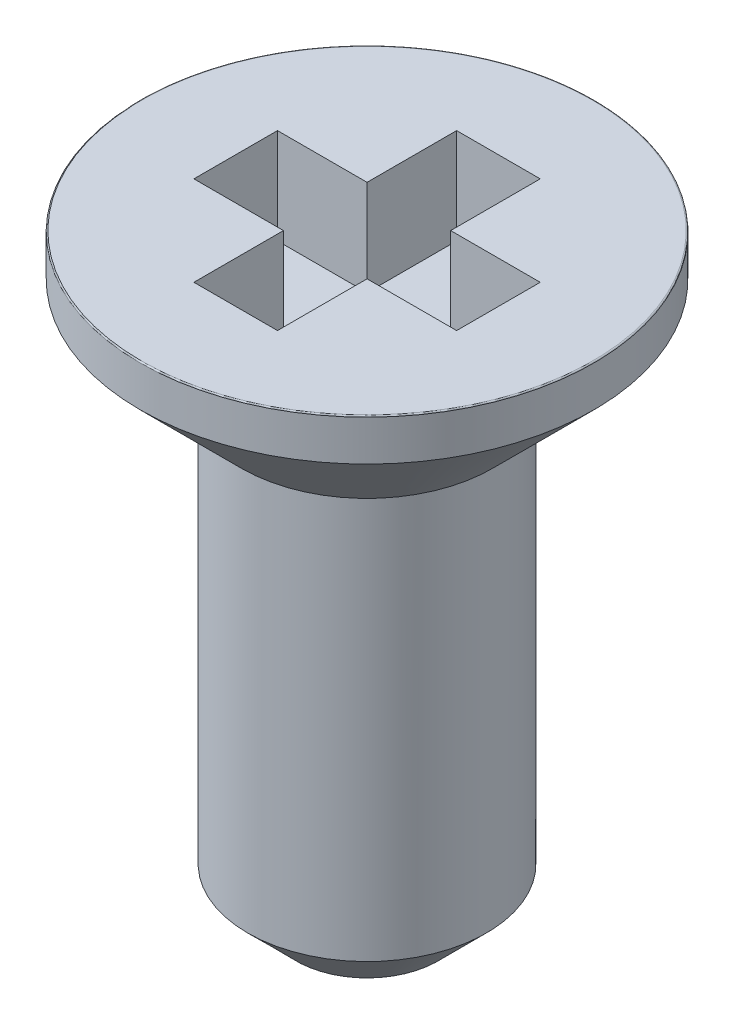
ISO-10303-21;
HEADER;
FILE_DESCRIPTION(('STEP AP214'),'2;1');
FILE_NAME('part.step','',(''),(''),'','','');
FILE_SCHEMA(('AUTOMOTIVE_DESIGN { 1 0 10303 214 1 1 1 1 }'));
ENDSEC;
DATA;
#1=APPLICATION_CONTEXT('core data for automotive mechanical design processes');
#2=APPLICATION_PROTOCOL_DEFINITION('international standard','automotive_design',2000,#1);
#3=PRODUCT_CONTEXT('',#1,'mechanical');
#4=PRODUCT('Part','Part','',(#3));
#5=PRODUCT_RELATED_PRODUCT_CATEGORY('part','',(#4));
#6=PRODUCT_DEFINITION_FORMATION('','',#4);
#7=PRODUCT_DEFINITION_CONTEXT('part definition',#1,'design');
#8=PRODUCT_DEFINITION('design','',#6,#7);
#9=PRODUCT_DEFINITION_SHAPE('','',#8);
#10=(LENGTH_UNIT() NAMED_UNIT(*) SI_UNIT(.MILLI.,.METRE.));
#11=(NAMED_UNIT(*) PLANE_ANGLE_UNIT() SI_UNIT($,.RADIAN.));
#12=(NAMED_UNIT(*) SI_UNIT($,.STERADIAN.) SOLID_ANGLE_UNIT());
#13=UNCERTAINTY_MEASURE_WITH_UNIT(LENGTH_MEASURE(1.E-05),#10,'distance_accuracy_value','');
#14=(GEOMETRIC_REPRESENTATION_CONTEXT(3) GLOBAL_UNCERTAINTY_ASSIGNED_CONTEXT((#13)) GLOBAL_UNIT_ASSIGNED_CONTEXT((#10,
#11,#12)) REPRESENTATION_CONTEXT('',''));
#15=CARTESIAN_POINT('',(0.,0.,0.));
#16=DIRECTION('',(0.,0.,1.));
#17=DIRECTION('',(1.,0.,0.));
#18=AXIS2_PLACEMENT_3D('',#15,#16,#17);
#19=CARTESIAN_POINT('',(1.9,0.,0.));
#20=DIRECTION('',(0.,1.,0.));
#21=DIRECTION('',(0.,0.,1.));
#22=AXIS2_PLACEMENT_3D('',#19,#20,#21);
#23=PLANE('',#22);
#24=CARTESIAN_POINT('',(0.,0.,0.));
#25=DIRECTION('',(0.,1.,0.));
#26=DIRECTION('',(0.,0.,1.));
#27=AXIS2_PLACEMENT_3D('',#24,#25,#26);
#28=CIRCLE('',#27,1.05);
#29=CARTESIAN_POINT('',(0.,0.,1.05));
#30=VERTEX_POINT('',#29);
#31=EDGE_CURVE('E12',#30,#30,#28,.F.);
#32=ORIENTED_EDGE('',*,*,#31,.T.);
#33=EDGE_LOOP('',(#32));
#34=FACE_BOUND('',#33,.T.);
#35=CARTESIAN_POINT('',(0.,0.,0.));
#36=DIRECTION('',(0.,1.,0.));
#37=DIRECTION('',(0.,0.,1.));
#38=AXIS2_PLACEMENT_3D('',#35,#36,#37);
#39=CIRCLE('',#38,1.);
#40=CARTESIAN_POINT('',(0.,0.,1.));
#41=VERTEX_POINT('',#40);
#42=EDGE_CURVE('E205',#41,#41,#39,.F.);
#43=ORIENTED_EDGE('',*,*,#42,.F.);
#44=EDGE_LOOP('',(#43));
#45=FACE_BOUND('',#44,.T.);
#46=ADVANCED_FACE('F33',(#34,#45),#23,.F.);
#47=CARTESIAN_POINT('',(0.35,0.4,1.1));
#48=DIRECTION('',(1.,0.,0.));
#49=DIRECTION('',(0.,0.,-1.));
#50=AXIS2_PLACEMENT_3D('',#47,#48,#49);
#51=PLANE('',#50);
#52=DIRECTION('',(0.,1.,0.));
#53=VECTOR('',#52,1.);
#54=CARTESIAN_POINT('',(0.35,0.4,0.349999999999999));
#55=LINE('',#54,#53);
#56=CARTESIAN_POINT('',(0.35,0.4,0.349999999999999));
#57=VERTEX_POINT('',#56);
#58=CARTESIAN_POINT('',(0.35,1.2,0.349999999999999));
#59=VERTEX_POINT('',#58);
#60=EDGE_CURVE('E155',#57,#59,#55,.T.);
#61=ORIENTED_EDGE('',*,*,#60,.F.);
#62=DIRECTION('',(0.,0.,-1.));
#63=VECTOR('',#62,1.);
#64=CARTESIAN_POINT('',(0.35,0.4,1.1));
#65=LINE('',#64,#63);
#66=CARTESIAN_POINT('',(0.35,0.4,1.1));
#67=VERTEX_POINT('',#66);
#68=EDGE_CURVE('E164',#67,#57,#65,.T.);
#69=ORIENTED_EDGE('',*,*,#68,.F.);
#70=DIRECTION('',(0.,1.,0.));
#71=VECTOR('',#70,1.);
#72=CARTESIAN_POINT('',(0.35,0.4,1.1));
#73=LINE('',#72,#71);
#74=CARTESIAN_POINT('',(0.35,1.2,1.1));
#75=VERTEX_POINT('',#74);
#76=EDGE_CURVE('E190',#67,#75,#73,.T.);
#77=ORIENTED_EDGE('',*,*,#76,.T.);
#78=DIRECTION('',(0.,0.,-1.));
#79=VECTOR('',#78,1.);
#80=CARTESIAN_POINT('',(0.35,1.2,1.1));
#81=LINE('',#80,#79);
#82=EDGE_CURVE('E177',#75,#59,#81,.T.);
#83=ORIENTED_EDGE('',*,*,#82,.T.);
#84=EDGE_LOOP('',(#61,#69,#77,#83));
#85=FACE_BOUND('',#84,.T.);
#86=ADVANCED_FACE('F229',(#85),#51,.F.);
#87=CARTESIAN_POINT('',(-0.35,0.4,1.1));
#88=DIRECTION('',(1.,0.,0.));
#89=DIRECTION('',(0.,0.,-1.));
#90=AXIS2_PLACEMENT_3D('',#87,#88,#89);
#91=PLANE('',#90);
#92=DIRECTION('',(0.,0.,-1.));
#93=VECTOR('',#92,1.);
#94=CARTESIAN_POINT('',(-0.35,0.4,1.1));
#95=LINE('',#94,#93);
#96=CARTESIAN_POINT('',(-0.35,0.4,1.1));
#97=VERTEX_POINT('',#96);
#98=CARTESIAN_POINT('',(-0.35,0.4,0.35));
#99=VERTEX_POINT('',#98);
#100=EDGE_CURVE('E171',#97,#99,#95,.T.);
#101=ORIENTED_EDGE('',*,*,#100,.T.);
#102=DIRECTION('',(0.,1.,0.));
#103=VECTOR('',#102,1.);
#104=CARTESIAN_POINT('',(-0.35,0.4,0.350000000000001));
#105=LINE('',#104,#103);
#106=CARTESIAN_POINT('',(-0.35,1.2,0.350000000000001));
#107=VERTEX_POINT('',#106);
#108=EDGE_CURVE('E152',#99,#107,#105,.T.);
#109=ORIENTED_EDGE('',*,*,#108,.T.);
#110=DIRECTION('',(0.,0.,-1.));
#111=VECTOR('',#110,1.);
#112=CARTESIAN_POINT('',(-0.35,1.2,1.1));
#113=LINE('',#112,#111);
#114=CARTESIAN_POINT('',(-0.35,1.2,1.1));
#115=VERTEX_POINT('',#114);
#116=EDGE_CURVE('E184',#115,#107,#113,.T.);
#117=ORIENTED_EDGE('',*,*,#116,.F.);
#118=DIRECTION('',(0.,1.,0.));
#119=VECTOR('',#118,1.);
#120=CARTESIAN_POINT('',(-0.35,0.4,1.1));
#121=LINE('',#120,#119);
#122=EDGE_CURVE('E193',#97,#115,#121,.T.);
#123=ORIENTED_EDGE('',*,*,#122,.F.);
#124=EDGE_LOOP('',(#101,#109,#117,#123));
#125=FACE_BOUND('',#124,.T.);
#126=ADVANCED_FACE('F235',(#125),#91,.T.);
#127=CARTESIAN_POINT('',(0.,11.592517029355,0.));
#128=DIRECTION('',(0.,1.,0.));
#129=DIRECTION('',(0.,0.,1.));
#130=AXIS2_PLACEMENT_3D('',#127,#128,#129);
#131=CYLINDRICAL_SURFACE('',#130,1.9);
#132=CARTESIAN_POINT('',(0.,0.85,0.));
#133=DIRECTION('',(0.,1.,0.));
#134=DIRECTION('',(0.,0.,1.));
#135=AXIS2_PLACEMENT_3D('',#132,#133,#134);
#136=CIRCLE('',#135,1.9);
#137=CARTESIAN_POINT('',(0.,0.85,1.9));
#138=VERTEX_POINT('',#137);
#139=EDGE_CURVE('E41',#138,#138,#136,.T.);
#140=ORIENTED_EDGE('',*,*,#139,.T.);
#141=EDGE_LOOP('',(#140));
#142=FACE_BOUND('',#141,.T.);
#143=CARTESIAN_POINT('',(0.,1.19,0.));
#144=DIRECTION('',(0.,1.,0.));
#145=DIRECTION('',(0.,0.,1.));
#146=AXIS2_PLACEMENT_3D('',#143,#144,#145);
#147=CIRCLE('',#146,1.9);
#148=CARTESIAN_POINT('',(0.,1.19,1.9));
#149=VERTEX_POINT('',#148);
#150=EDGE_CURVE('E202',#149,#149,#147,.T.);
#151=ORIENTED_EDGE('',*,*,#150,.F.);
#152=EDGE_LOOP('',(#151));
#153=FACE_BOUND('',#152,.T.);
#154=ADVANCED_FACE('F216',(#142,#153),#131,.T.);
#155=CARTESIAN_POINT('',(0.,1.19,0.));
#156=DIRECTION('',(0.,1.,0.));
#157=DIRECTION('',(0.,0.,1.));
#158=AXIS2_PLACEMENT_3D('',#155,#156,#157);
#159=TOROIDAL_SURFACE('',#158,1.89,0.01);
#160=CARTESIAN_POINT('',(0.,1.2,0.));
#161=DIRECTION('',(0.,1.,0.));
#162=DIRECTION('',(0.,0.,1.));
#163=AXIS2_PLACEMENT_3D('',#160,#161,#162);
#164=CIRCLE('',#163,1.89);
#165=CARTESIAN_POINT('',(0.,1.2,1.89));
#166=VERTEX_POINT('',#165);
#167=EDGE_CURVE('E192',#166,#166,#164,.T.);
#168=ORIENTED_EDGE('',*,*,#167,.F.);
#169=EDGE_LOOP('',(#168));
#170=FACE_BOUND('',#169,.T.);
#171=ORIENTED_EDGE('',*,*,#150,.T.);
#172=EDGE_LOOP('',(#171));
#173=FACE_BOUND('',#172,.T.);
#174=ADVANCED_FACE('F243',(#170,#173),#159,.T.);
#175=CARTESIAN_POINT('',(0.,1.2,0.));
#176=DIRECTION('',(0.,-1.,0.));
#177=DIRECTION('',(0.,0.,-1.));
#178=AXIS2_PLACEMENT_3D('',#175,#176,#177);
#179=PLANE('',#178);
#180=CARTESIAN_POINT('',(0.35,1.2,-0.350000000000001));
#181=VERTEX_POINT('',#180);
#182=CARTESIAN_POINT('',(0.35,1.2,-1.1));
#183=VERTEX_POINT('',#182);
#184=EDGE_CURVE('E163',#181,#183,#81,.T.);
#185=ORIENTED_EDGE('',*,*,#184,.F.);
#186=DIRECTION('',(-1.,0.,0.));
#187=VECTOR('',#186,1.);
#188=CARTESIAN_POINT('',(1.1,1.2,-0.350000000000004));
#189=LINE('',#188,#187);
#190=CARTESIAN_POINT('',(1.1,1.2,-0.350000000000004));
#191=VERTEX_POINT('',#190);
#192=EDGE_CURVE('E432',#191,#181,#189,.T.);
#193=ORIENTED_EDGE('',*,*,#192,.F.);
#194=DIRECTION('',(0.,0.,1.));
#195=VECTOR('',#194,1.);
#196=CARTESIAN_POINT('',(1.1,1.2,-0.350000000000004));
#197=LINE('',#196,#195);
#198=CARTESIAN_POINT('',(1.1,1.2,0.349999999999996));
#199=VERTEX_POINT('',#198);
#200=EDGE_CURVE('E130',#191,#199,#197,.T.);
#201=ORIENTED_EDGE('',*,*,#200,.T.);
#202=DIRECTION('',(-1.,0.,0.));
#203=VECTOR('',#202,1.);
#204=CARTESIAN_POINT('',(1.1,1.2,0.349999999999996));
#205=LINE('',#204,#203);
#206=EDGE_CURVE('E417',#199,#59,#205,.T.);
#207=ORIENTED_EDGE('',*,*,#206,.T.);
#208=ORIENTED_EDGE('',*,*,#82,.F.);
#209=DIRECTION('',(-1.,0.,0.));
#210=VECTOR('',#209,1.);
#211=CARTESIAN_POINT('',(0.35,1.2,1.1));
#212=LINE('',#211,#210);
#213=EDGE_CURVE('E187',#75,#115,#212,.T.);
#214=ORIENTED_EDGE('',*,*,#213,.T.);
#215=ORIENTED_EDGE('',*,*,#116,.T.);
#216=CARTESIAN_POINT('',(-1.1,1.2,0.350000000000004));
#217=VERTEX_POINT('',#216);
#218=EDGE_CURVE('E423',#107,#217,#205,.T.);
#219=ORIENTED_EDGE('',*,*,#218,.T.);
#220=DIRECTION('',(0.,0.,-1.));
#221=VECTOR('',#220,1.);
#222=CARTESIAN_POINT('',(-1.1,1.2,0.350000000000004));
#223=LINE('',#222,#221);
#224=CARTESIAN_POINT('',(-1.1,1.2,-0.349999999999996));
#225=VERTEX_POINT('',#224);
#226=EDGE_CURVE('E427',#217,#225,#223,.T.);
#227=ORIENTED_EDGE('',*,*,#226,.T.);
#228=CARTESIAN_POINT('',(-0.35,1.2,-0.349999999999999));
#229=VERTEX_POINT('',#228);
#230=EDGE_CURVE('E143',#229,#225,#189,.T.);
#231=ORIENTED_EDGE('',*,*,#230,.F.);
#232=CARTESIAN_POINT('',(-0.35,1.2,-1.1));
#233=VERTEX_POINT('',#232);
#234=EDGE_CURVE('E183',#229,#233,#113,.T.);
#235=ORIENTED_EDGE('',*,*,#234,.T.);
#236=DIRECTION('',(1.,0.,0.));
#237=VECTOR('',#236,1.);
#238=CARTESIAN_POINT('',(-0.35,1.2,-1.1));
#239=LINE('',#238,#237);
#240=EDGE_CURVE('E180',#233,#183,#239,.T.);
#241=ORIENTED_EDGE('',*,*,#240,.T.);
#242=EDGE_LOOP('',(#185,#193,#201,#207,#208,#214,#215,#219,#227,#231,#235,#241));
#243=FACE_BOUND('',#242,.T.);
#244=ORIENTED_EDGE('',*,*,#167,.T.);
#245=EDGE_LOOP('',(#244));
#246=FACE_BOUND('',#245,.T.);
#247=ADVANCED_FACE('F246',(#243,#246),#179,.F.);
#248=CARTESIAN_POINT('',(0.35,0.4,-0.35));
#249=VERTEX_POINT('',#248);
#250=CARTESIAN_POINT('',(0.35,0.4,-1.1));
#251=VERTEX_POINT('',#250);
#252=EDGE_CURVE('E168',#249,#251,#65,.T.);
#253=ORIENTED_EDGE('',*,*,#252,.F.);
#254=DIRECTION('',(0.,1.,0.));
#255=VECTOR('',#254,1.);
#256=CARTESIAN_POINT('',(0.35,0.4,-0.350000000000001));
#257=LINE('',#256,#255);
#258=EDGE_CURVE('E160',#249,#181,#257,.T.);
#259=ORIENTED_EDGE('',*,*,#258,.T.);
#260=ORIENTED_EDGE('',*,*,#184,.T.);
#261=DIRECTION('',(0.,1.,0.));
#262=VECTOR('',#261,1.);
#263=CARTESIAN_POINT('',(0.35,0.4,-1.1));
#264=LINE('',#263,#262);
#265=EDGE_CURVE('E176',#251,#183,#264,.T.);
#266=ORIENTED_EDGE('',*,*,#265,.F.);
#267=EDGE_LOOP('',(#253,#259,#260,#266));
#268=FACE_BOUND('',#267,.T.);
#269=ADVANCED_FACE('F238',(#268),#51,.F.);
#270=CARTESIAN_POINT('',(0.35,0.4,1.1));
#271=DIRECTION('',(0.,0.,-1.));
#272=DIRECTION('',(-1.,0.,0.));
#273=AXIS2_PLACEMENT_3D('',#270,#271,#272);
#274=PLANE('',#273);
#275=ORIENTED_EDGE('',*,*,#213,.F.);
#276=ORIENTED_EDGE('',*,*,#76,.F.);
#277=DIRECTION('',(-1.,0.,0.));
#278=VECTOR('',#277,1.);
#279=CARTESIAN_POINT('',(0.35,0.4,1.1));
#280=LINE('',#279,#278);
#281=EDGE_CURVE('E174',#67,#97,#280,.T.);
#282=ORIENTED_EDGE('',*,*,#281,.T.);
#283=ORIENTED_EDGE('',*,*,#122,.T.);
#284=EDGE_LOOP('',(#275,#276,#282,#283));
#285=FACE_BOUND('',#284,.T.);
#286=ADVANCED_FACE('F252',(#285),#274,.T.);
#287=DIRECTION('',(0.,1.,0.));
#288=VECTOR('',#287,1.);
#289=CARTESIAN_POINT('',(-0.35,0.4,-0.349999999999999));
#290=LINE('',#289,#288);
#291=CARTESIAN_POINT('',(-0.35,0.4,-0.349999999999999));
#292=VERTEX_POINT('',#291);
#293=EDGE_CURVE('E158',#292,#229,#290,.T.);
#294=ORIENTED_EDGE('',*,*,#293,.F.);
#295=CARTESIAN_POINT('',(-0.35,0.4,-1.1));
#296=VERTEX_POINT('',#295);
#297=EDGE_CURVE('E126',#292,#296,#95,.T.);
#298=ORIENTED_EDGE('',*,*,#297,.T.);
#299=DIRECTION('',(0.,1.,0.));
#300=VECTOR('',#299,1.);
#301=CARTESIAN_POINT('',(-0.35,0.4,-1.1));
#302=LINE('',#301,#300);
#303=EDGE_CURVE('E195',#296,#233,#302,.T.);
#304=ORIENTED_EDGE('',*,*,#303,.T.);
#305=ORIENTED_EDGE('',*,*,#234,.F.);
#306=EDGE_LOOP('',(#294,#298,#304,#305));
#307=FACE_BOUND('',#306,.T.);
#308=ADVANCED_FACE('F257',(#307),#91,.T.);
#309=CARTESIAN_POINT('',(-0.35,0.4,-1.1));
#310=DIRECTION('',(0.,0.,1.));
#311=DIRECTION('',(1.,0.,0.));
#312=AXIS2_PLACEMENT_3D('',#309,#310,#311);
#313=PLANE('',#312);
#314=ORIENTED_EDGE('',*,*,#240,.F.);
#315=ORIENTED_EDGE('',*,*,#303,.F.);
#316=DIRECTION('',(1.,0.,0.));
#317=VECTOR('',#316,1.);
#318=CARTESIAN_POINT('',(-0.35,0.4,-1.1));
#319=LINE('',#318,#317);
#320=EDGE_CURVE('E167',#296,#251,#319,.T.);
#321=ORIENTED_EDGE('',*,*,#320,.T.);
#322=ORIENTED_EDGE('',*,*,#265,.T.);
#323=EDGE_LOOP('',(#314,#315,#321,#322));
#324=FACE_BOUND('',#323,.T.);
#325=ADVANCED_FACE('F254',(#324),#313,.T.);
#326=CARTESIAN_POINT('',(0.35,0.4,-1.1));
#327=DIRECTION('',(0.,-1.,0.));
#328=DIRECTION('',(0.,0.,-1.));
#329=AXIS2_PLACEMENT_3D('',#326,#327,#328);
#330=PLANE('',#329);
#331=ORIENTED_EDGE('',*,*,#297,.F.);
#332=DIRECTION('',(-1.,0.,0.));
#333=VECTOR('',#332,1.);
#334=CARTESIAN_POINT('',(1.1,0.4,-0.350000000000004));
#335=LINE('',#334,#333);
#336=CARTESIAN_POINT('',(-1.1,0.4,-0.349999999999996));
#337=VERTEX_POINT('',#336);
#338=EDGE_CURVE('E121',#292,#337,#335,.T.);
#339=ORIENTED_EDGE('',*,*,#338,.T.);
#340=DIRECTION('',(0.,0.,-1.));
#341=VECTOR('',#340,1.);
#342=CARTESIAN_POINT('',(-1.1,0.4,0.350000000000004));
#343=LINE('',#342,#341);
#344=CARTESIAN_POINT('',(-1.1,0.4,0.350000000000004));
#345=VERTEX_POINT('',#344);
#346=EDGE_CURVE('E124',#345,#337,#343,.T.);
#347=ORIENTED_EDGE('',*,*,#346,.F.);
#348=DIRECTION('',(-1.,0.,0.));
#349=VECTOR('',#348,1.);
#350=CARTESIAN_POINT('',(1.1,0.4,0.349999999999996));
#351=LINE('',#350,#349);
#352=EDGE_CURVE('E48',#99,#345,#351,.T.);
#353=ORIENTED_EDGE('',*,*,#352,.F.);
#354=ORIENTED_EDGE('',*,*,#100,.F.);
#355=ORIENTED_EDGE('',*,*,#281,.F.);
#356=ORIENTED_EDGE('',*,*,#68,.T.);
#357=CARTESIAN_POINT('',(1.1,0.4,0.349999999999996));
#358=VERTEX_POINT('',#357);
#359=EDGE_CURVE('E148',#358,#57,#351,.T.);
#360=ORIENTED_EDGE('',*,*,#359,.F.);
#361=DIRECTION('',(0.,0.,1.));
#362=VECTOR('',#361,1.);
#363=CARTESIAN_POINT('',(1.1,0.4,-0.350000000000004));
#364=LINE('',#363,#362);
#365=CARTESIAN_POINT('',(1.1,0.4,-0.350000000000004));
#366=VERTEX_POINT('',#365);
#367=EDGE_CURVE('E144',#366,#358,#364,.T.);
#368=ORIENTED_EDGE('',*,*,#367,.F.);
#369=EDGE_CURVE('E55',#366,#249,#335,.T.);
#370=ORIENTED_EDGE('',*,*,#369,.T.);
#371=ORIENTED_EDGE('',*,*,#252,.T.);
#372=ORIENTED_EDGE('',*,*,#320,.F.);
#373=EDGE_LOOP('',(#331,#339,#347,#353,#354,#355,#356,#360,#368,#370,#371,#372));
#374=FACE_BOUND('',#373,.T.);
#375=ADVANCED_FACE('F123',(#374),#330,.F.);
#376=CARTESIAN_POINT('',(1.1,0.4,0.349999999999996));
#377=DIRECTION('',(0.,0.,-1.));
#378=DIRECTION('',(-1.,0.,0.));
#379=AXIS2_PLACEMENT_3D('',#376,#377,#378);
#380=PLANE('',#379);
#381=ORIENTED_EDGE('',*,*,#352,.T.);
#382=DIRECTION('',(0.,1.,0.));
#383=VECTOR('',#382,1.);
#384=CARTESIAN_POINT('',(-1.1,0.4,0.350000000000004));
#385=LINE('',#384,#383);
#386=EDGE_CURVE('E139',#345,#217,#385,.T.);
#387=ORIENTED_EDGE('',*,*,#386,.T.);
#388=ORIENTED_EDGE('',*,*,#218,.F.);
#389=ORIENTED_EDGE('',*,*,#108,.F.);
#390=EDGE_LOOP('',(#381,#387,#388,#389));
#391=FACE_BOUND('',#390,.T.);
#392=ADVANCED_FACE('F267',(#391),#380,.T.);
#393=CARTESIAN_POINT('',(1.1,0.4,-0.350000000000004));
#394=DIRECTION('',(0.,0.,-1.));
#395=DIRECTION('',(-1.,0.,0.));
#396=AXIS2_PLACEMENT_3D('',#393,#394,#395);
#397=PLANE('',#396);
#398=ORIENTED_EDGE('',*,*,#293,.T.);
#399=ORIENTED_EDGE('',*,*,#230,.T.);
#400=DIRECTION('',(0.,1.,0.));
#401=VECTOR('',#400,1.);
#402=CARTESIAN_POINT('',(-1.1,0.4,-0.349999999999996));
#403=LINE('',#402,#401);
#404=EDGE_CURVE('E137',#337,#225,#403,.T.);
#405=ORIENTED_EDGE('',*,*,#404,.F.);
#406=ORIENTED_EDGE('',*,*,#338,.F.);
#407=EDGE_LOOP('',(#398,#399,#405,#406));
#408=FACE_BOUND('',#407,.T.);
#409=ADVANCED_FACE('F141',(#408),#397,.F.);
#410=CARTESIAN_POINT('',(-1.1,0.4,0.350000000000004));
#411=DIRECTION('',(1.,0.,0.));
#412=DIRECTION('',(0.,0.,-1.));
#413=AXIS2_PLACEMENT_3D('',#410,#411,#412);
#414=PLANE('',#413);
#415=ORIENTED_EDGE('',*,*,#226,.F.);
#416=ORIENTED_EDGE('',*,*,#386,.F.);
#417=ORIENTED_EDGE('',*,*,#346,.T.);
#418=ORIENTED_EDGE('',*,*,#404,.T.);
#419=EDGE_LOOP('',(#415,#416,#417,#418));
#420=FACE_BOUND('',#419,.T.);
#421=ADVANCED_FACE('F136',(#420),#414,.T.);
#422=ORIENTED_EDGE('',*,*,#369,.F.);
#423=DIRECTION('',(0.,1.,0.));
#424=VECTOR('',#423,1.);
#425=CARTESIAN_POINT('',(1.1,0.4,-0.350000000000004));
#426=LINE('',#425,#424);
#427=EDGE_CURVE('E156',#366,#191,#426,.T.);
#428=ORIENTED_EDGE('',*,*,#427,.T.);
#429=ORIENTED_EDGE('',*,*,#192,.T.);
#430=ORIENTED_EDGE('',*,*,#258,.F.);
#431=EDGE_LOOP('',(#422,#428,#429,#430));
#432=FACE_BOUND('',#431,.T.);
#433=ADVANCED_FACE('F270',(#432),#397,.F.);
#434=ORIENTED_EDGE('',*,*,#60,.T.);
#435=ORIENTED_EDGE('',*,*,#206,.F.);
#436=DIRECTION('',(0.,1.,0.));
#437=VECTOR('',#436,1.);
#438=CARTESIAN_POINT('',(1.1,0.4,0.349999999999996));
#439=LINE('',#438,#437);
#440=EDGE_CURVE('E146',#358,#199,#439,.T.);
#441=ORIENTED_EDGE('',*,*,#440,.F.);
#442=ORIENTED_EDGE('',*,*,#359,.T.);
#443=EDGE_LOOP('',(#434,#435,#441,#442));
#444=FACE_BOUND('',#443,.T.);
#445=ADVANCED_FACE('F276',(#444),#380,.T.);
#446=CARTESIAN_POINT('',(1.1,0.4,-0.350000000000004));
#447=DIRECTION('',(-1.,0.,0.));
#448=DIRECTION('',(0.,0.,1.));
#449=AXIS2_PLACEMENT_3D('',#446,#447,#448);
#450=PLANE('',#449);
#451=ORIENTED_EDGE('',*,*,#200,.F.);
#452=ORIENTED_EDGE('',*,*,#427,.F.);
#453=ORIENTED_EDGE('',*,*,#367,.T.);
#454=ORIENTED_EDGE('',*,*,#440,.T.);
#455=EDGE_LOOP('',(#451,#452,#453,#454));
#456=FACE_BOUND('',#455,.T.);
#457=ADVANCED_FACE('F277',(#456),#450,.T.);
#458=CARTESIAN_POINT('',(0.,-11.6284271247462,0.));
#459=DIRECTION('',(0.,1.,0.));
#460=DIRECTION('',(0.,0.,1.));
#461=AXIS2_PLACEMENT_3D('',#458,#459,#460);
#462=CYLINDRICAL_SURFACE('',#461,1.);
#463=CARTESIAN_POINT('',(0.,-3.3936,0.));
#464=DIRECTION('',(0.,-1.,0.));
#465=DIRECTION('',(0.,0.,-1.));
#466=AXIS2_PLACEMENT_3D('',#463,#464,#465);
#467=CIRCLE('',#466,1.);
#468=CARTESIAN_POINT('',(0.,-3.3936,-1.));
#469=VERTEX_POINT('',#468);
#470=EDGE_CURVE('E211',#469,#469,#467,.F.);
#471=ORIENTED_EDGE('',*,*,#470,.T.);
#472=EDGE_LOOP('',(#471));
#473=FACE_BOUND('',#472,.T.);
#474=ORIENTED_EDGE('',*,*,#42,.T.);
#475=EDGE_LOOP('',(#474));
#476=FACE_BOUND('',#475,.T.);
#477=ADVANCED_FACE('F280',(#473,#476),#462,.T.);
#478=CARTESIAN_POINT('',(0.,-3.8,0.));
#479=DIRECTION('',(0.,-1.,0.));
#480=DIRECTION('',(0.,0.,-1.));
#481=AXIS2_PLACEMENT_3D('',#478,#479,#480);
#482=PLANE('',#481);
#483=CARTESIAN_POINT('',(0.,-3.8,0.));
#484=DIRECTION('',(0.,-1.,0.));
#485=DIRECTION('',(0.,0.,-1.));
#486=AXIS2_PLACEMENT_3D('',#483,#484,#485);
#487=CIRCLE('',#486,0.593599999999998);
#488=CARTESIAN_POINT('',(0.,-3.8,-0.593599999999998));
#489=VERTEX_POINT('',#488);
#490=EDGE_CURVE('E208',#489,#489,#487,.T.);
#491=ORIENTED_EDGE('',*,*,#490,.T.);
#492=EDGE_LOOP('',(#491));
#493=FACE_BOUND('',#492,.T.);
#494=ADVANCED_FACE('F225',(#493),#482,.T.);
#495=CARTESIAN_POINT('',(0.,-3.8,0.));
#496=DIRECTION('',(0.,1.,0.));
#497=DIRECTION('',(0.,0.,1.));
#498=AXIS2_PLACEMENT_3D('',#495,#496,#497);
#499=CONICAL_SURFACE('',#498,0.593599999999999,0.785398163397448);
#500=ORIENTED_EDGE('',*,*,#470,.F.);
#501=EDGE_LOOP('',(#500));
#502=FACE_BOUND('',#501,.T.);
#503=ORIENTED_EDGE('',*,*,#490,.F.);
#504=EDGE_LOOP('',(#503));
#505=FACE_BOUND('',#504,.T.);
#506=ADVANCED_FACE('F220',(#502,#505),#499,.T.);
#507=CARTESIAN_POINT('',(0.,0.85,0.));
#508=DIRECTION('',(0.,1.,0.));
#509=DIRECTION('',(0.,0.,1.));
#510=AXIS2_PLACEMENT_3D('',#507,#508,#509);
#511=CONICAL_SURFACE('',#510,1.9,0.785398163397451);
#512=ORIENTED_EDGE('',*,*,#31,.F.);
#513=EDGE_LOOP('',(#512));
#514=FACE_BOUND('',#513,.T.);
#515=ORIENTED_EDGE('',*,*,#139,.F.);
#516=EDGE_LOOP('',(#515));
#517=FACE_BOUND('',#516,.T.);
#518=ADVANCED_FACE('F35',(#514,#517),#511,.T.);
#519=CLOSED_SHELL('',(#46,#86,#126,#154,#174,#247,#269,#286,#308,#325,#375,#392,#409,#421,#433,
#445,#457,#477,#494,#506,#518));
#520=MANIFOLD_SOLID_BREP('B2',#519);
#521=ADVANCED_BREP_SHAPE_REPRESENTATION('',(#18,#520),#14);
#522=SHAPE_DEFINITION_REPRESENTATION(#9,#521);
ENDSEC;
END-ISO-10303-21;
